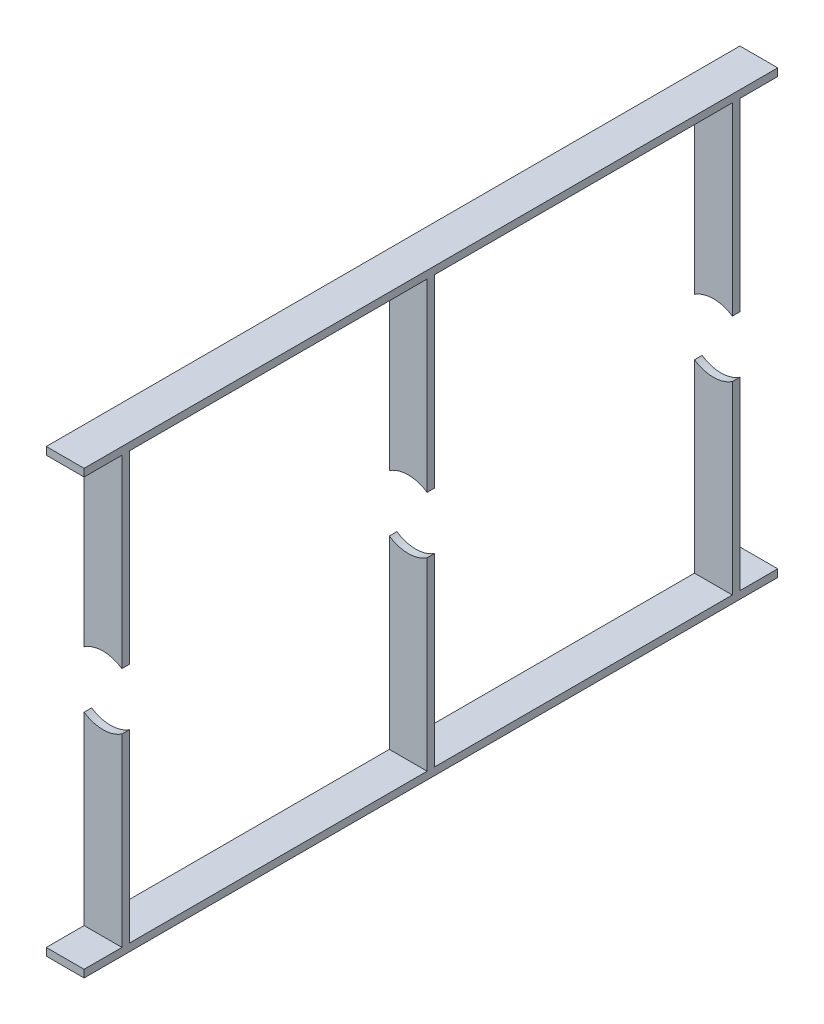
ISO-10303-21;
HEADER;
FILE_DESCRIPTION(('STEP AP214'),'2;1');
FILE_NAME('part.step','',(''),(''),'','','');
FILE_SCHEMA(('AUTOMOTIVE_DESIGN { 1 0 10303 214 1 1 1 1 }'));
ENDSEC;
DATA;
#1=APPLICATION_CONTEXT('core data for automotive mechanical design processes');
#2=APPLICATION_PROTOCOL_DEFINITION('international standard','automotive_design',2000,#1);
#3=PRODUCT_CONTEXT('',#1,'mechanical');
#4=PRODUCT('Part','Part','',(#3));
#5=PRODUCT_RELATED_PRODUCT_CATEGORY('part','',(#4));
#6=PRODUCT_DEFINITION_FORMATION('','',#4);
#7=PRODUCT_DEFINITION_CONTEXT('part definition',#1,'design');
#8=PRODUCT_DEFINITION('design','',#6,#7);
#9=PRODUCT_DEFINITION_SHAPE('','',#8);
#10=(LENGTH_UNIT() NAMED_UNIT(*) SI_UNIT(.MILLI.,.METRE.));
#11=(NAMED_UNIT(*) PLANE_ANGLE_UNIT() SI_UNIT($,.RADIAN.));
#12=(NAMED_UNIT(*) SI_UNIT($,.STERADIAN.) SOLID_ANGLE_UNIT());
#13=UNCERTAINTY_MEASURE_WITH_UNIT(LENGTH_MEASURE(1.E-05),#10,'distance_accuracy_value','');
#14=(GEOMETRIC_REPRESENTATION_CONTEXT(3) GLOBAL_UNCERTAINTY_ASSIGNED_CONTEXT((#13)) GLOBAL_UNIT_ASSIGNED_CONTEXT((#10,
#11,#12)) REPRESENTATION_CONTEXT('',''));
#15=CARTESIAN_POINT('',(0.,0.,0.));
#16=DIRECTION('',(0.,0.,1.));
#17=DIRECTION('',(1.,0.,0.));
#18=AXIS2_PLACEMENT_3D('',#15,#16,#17);
#19=CARTESIAN_POINT('',(30.0000000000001,-338.,490.));
#20=DIRECTION('',(1.,0.,0.));
#21=DIRECTION('',(0.,0.,-1.));
#22=AXIS2_PLACEMENT_3D('',#19,#20,#21);
#23=PLANE('',#22);
#24=DIRECTION('',(0.,0.,1.));
#25=VECTOR('',#24,1.);
#26=CARTESIAN_POINT('',(30.0000000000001,44.8998886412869,-494.));
#27=LINE('',#26,#25);
#28=CARTESIAN_POINT('',(30.0000000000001,44.8998886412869,-490.));
#29=VERTEX_POINT('',#28);
#30=CARTESIAN_POINT('',(30.0000000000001,44.8998886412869,-478.));
#31=VERTEX_POINT('',#30);
#32=EDGE_CURVE('E85',#29,#31,#27,.T.);
#33=ORIENTED_EDGE('',*,*,#32,.F.);
#34=DIRECTION('',(0.,1.,0.));
#35=VECTOR('',#34,1.);
#36=CARTESIAN_POINT('',(30.0000000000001,-338.,-490.));
#37=LINE('',#36,#35);
#38=CARTESIAN_POINT('',(30.,338.,-490.));
#39=VERTEX_POINT('',#38);
#40=EDGE_CURVE('E212',#29,#39,#37,.T.);
#41=ORIENTED_EDGE('',*,*,#40,.T.);
#42=DIRECTION('',(0.,0.,-1.));
#43=VECTOR('',#42,1.);
#44=CARTESIAN_POINT('',(30.,338.,550.));
#45=LINE('',#44,#43);
#46=CARTESIAN_POINT('',(30.,338.,-550.));
#47=VERTEX_POINT('',#46);
#48=EDGE_CURVE('E184',#39,#47,#45,.T.);
#49=ORIENTED_EDGE('',*,*,#48,.T.);
#50=DIRECTION('',(0.,-1.,0.));
#51=VECTOR('',#50,1.);
#52=CARTESIAN_POINT('',(30.,350.,-550.));
#53=LINE('',#52,#51);
#54=CARTESIAN_POINT('',(30.,350.,-550.));
#55=VERTEX_POINT('',#54);
#56=EDGE_CURVE('E228',#55,#47,#53,.T.);
#57=ORIENTED_EDGE('',*,*,#56,.F.);
#58=DIRECTION('',(0.,0.,-1.));
#59=VECTOR('',#58,1.);
#60=CARTESIAN_POINT('',(30.,350.,550.));
#61=LINE('',#60,#59);
#62=CARTESIAN_POINT('',(30.,350.,550.));
#63=VERTEX_POINT('',#62);
#64=EDGE_CURVE('E231',#63,#55,#61,.T.);
#65=ORIENTED_EDGE('',*,*,#64,.F.);
#66=DIRECTION('',(0.,-1.,0.));
#67=VECTOR('',#66,1.);
#68=CARTESIAN_POINT('',(30.,350.,550.));
#69=LINE('',#68,#67);
#70=CARTESIAN_POINT('',(30.,338.,550.));
#71=VERTEX_POINT('',#70);
#72=EDGE_CURVE('E233',#63,#71,#69,.T.);
#73=ORIENTED_EDGE('',*,*,#72,.T.);
#74=CARTESIAN_POINT('',(30.0000000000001,338.,490.));
#75=VERTEX_POINT('',#74);
#76=EDGE_CURVE('E235',#71,#75,#45,.T.);
#77=ORIENTED_EDGE('',*,*,#76,.T.);
#78=DIRECTION('',(0.,1.,0.));
#79=VECTOR('',#78,1.);
#80=CARTESIAN_POINT('',(30.0000000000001,-338.,490.));
#81=LINE('',#80,#79);
#82=CARTESIAN_POINT('',(30.0000000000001,44.8998886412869,490.));
#83=VERTEX_POINT('',#82);
#84=EDGE_CURVE('E206',#83,#75,#81,.T.);
#85=ORIENTED_EDGE('',*,*,#84,.F.);
#86=DIRECTION('',(0.,0.,1.));
#87=VECTOR('',#86,1.);
#88=CARTESIAN_POINT('',(30.0000000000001,44.8998886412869,-10.));
#89=LINE('',#88,#87);
#90=CARTESIAN_POINT('',(30.0000000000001,44.8998886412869,478.));
#91=VERTEX_POINT('',#90);
#92=EDGE_CURVE('E270',#91,#83,#89,.T.);
#93=ORIENTED_EDGE('',*,*,#92,.F.);
#94=DIRECTION('',(0.,1.,0.));
#95=VECTOR('',#94,1.);
#96=CARTESIAN_POINT('',(30.0000000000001,-338.,478.));
#97=LINE('',#96,#95);
#98=CARTESIAN_POINT('',(30.0000000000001,338.,478.));
#99=VERTEX_POINT('',#98);
#100=EDGE_CURVE('E238',#91,#99,#97,.T.);
#101=ORIENTED_EDGE('',*,*,#100,.T.);
#102=CARTESIAN_POINT('',(30.,338.,6.00000000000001));
#103=VERTEX_POINT('',#102);
#104=EDGE_CURVE('E201',#99,#103,#45,.T.);
#105=ORIENTED_EDGE('',*,*,#104,.T.);
#106=DIRECTION('',(0.,1.,0.));
#107=VECTOR('',#106,1.);
#108=CARTESIAN_POINT('',(30.0000000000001,-338.,6.00000000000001));
#109=LINE('',#108,#107);
#110=CARTESIAN_POINT('',(30.0000000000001,44.8998886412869,5.99999999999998));
#111=VERTEX_POINT('',#110);
#112=EDGE_CURVE('E168',#111,#103,#109,.T.);
#113=ORIENTED_EDGE('',*,*,#112,.F.);
#114=CARTESIAN_POINT('',(30.0000000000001,44.8998886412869,-6.00000000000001));
#115=VERTEX_POINT('',#114);
#116=EDGE_CURVE('E193',#115,#111,#27,.T.);
#117=ORIENTED_EDGE('',*,*,#116,.F.);
#118=DIRECTION('',(0.,1.,0.));
#119=VECTOR('',#118,1.);
#120=CARTESIAN_POINT('',(30.0000000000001,-338.,-6.00000000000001));
#121=LINE('',#120,#119);
#122=CARTESIAN_POINT('',(30.,338.,-6.00000000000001));
#123=VERTEX_POINT('',#122);
#124=EDGE_CURVE('E199',#115,#123,#121,.T.);
#125=ORIENTED_EDGE('',*,*,#124,.T.);
#126=CARTESIAN_POINT('',(30.,338.,-478.));
#127=VERTEX_POINT('',#126);
#128=EDGE_CURVE('E198',#123,#127,#45,.T.);
#129=ORIENTED_EDGE('',*,*,#128,.T.);
#130=DIRECTION('',(0.,1.,0.));
#131=VECTOR('',#130,1.);
#132=CARTESIAN_POINT('',(30.0000000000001,-338.,-478.));
#133=LINE('',#132,#131);
#134=EDGE_CURVE('E48',#31,#127,#133,.T.);
#135=ORIENTED_EDGE('',*,*,#134,.F.);
#136=EDGE_LOOP('',(#33,#41,#49,#57,#65,#73,#77,#85,#93,#101,#105,#113,#117,#125,#129,#135));
#137=FACE_BOUND('',#136,.T.);
#138=ADVANCED_FACE('F44',(#137),#23,.T.);
#139=CARTESIAN_POINT('',(30.0000000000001,-338.,-6.00000000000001));
#140=DIRECTION('',(0.,0.,-1.));
#141=DIRECTION('',(-1.,0.,0.));
#142=AXIS2_PLACEMENT_3D('',#139,#140,#141);
#143=PLANE('',#142);
#144=CARTESIAN_POINT('',(-4.53341068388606E-13,0.,-6.00000000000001));
#145=DIRECTION('',(0.,0.,-1.));
#146=DIRECTION('',(-1.,0.,0.));
#147=AXIS2_PLACEMENT_3D('',#144,#145,#146);
#148=CIRCLE('',#147,54.);
#149=CARTESIAN_POINT('',(-29.9999999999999,44.8998886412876,-6.00000000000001));
#150=VERTEX_POINT('',#149);
#151=EDGE_CURVE('E195',#150,#115,#148,.T.);
#152=ORIENTED_EDGE('',*,*,#151,.F.);
#153=DIRECTION('',(0.,1.,0.));
#154=VECTOR('',#153,1.);
#155=CARTESIAN_POINT('',(-29.9999999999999,-338.,-6.00000000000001));
#156=LINE('',#155,#154);
#157=CARTESIAN_POINT('',(-30.,338.,-6.00000000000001));
#158=VERTEX_POINT('',#157);
#159=EDGE_CURVE('E196',#150,#158,#156,.T.);
#160=ORIENTED_EDGE('',*,*,#159,.T.);
#161=DIRECTION('',(-1.,0.,0.));
#162=VECTOR('',#161,1.);
#163=CARTESIAN_POINT('',(30.0000000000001,338.,-6.00000000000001));
#164=LINE('',#163,#162);
#165=EDGE_CURVE('E192',#123,#158,#164,.T.);
#166=ORIENTED_EDGE('',*,*,#165,.F.);
#167=ORIENTED_EDGE('',*,*,#124,.F.);
#168=EDGE_LOOP('',(#152,#160,#166,#167));
#169=FACE_BOUND('',#168,.T.);
#170=ADVANCED_FACE('F324',(#169),#143,.T.);
#171=CARTESIAN_POINT('',(30.0000000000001,-338.,6.00000000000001));
#172=DIRECTION('',(0.,0.,1.));
#173=DIRECTION('',(1.,0.,0.));
#174=AXIS2_PLACEMENT_3D('',#171,#172,#173);
#175=PLANE('',#174);
#176=CARTESIAN_POINT('',(-4.53341068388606E-13,0.,5.99999999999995));
#177=DIRECTION('',(0.,0.,1.));
#178=DIRECTION('',(1.,0.,0.));
#179=AXIS2_PLACEMENT_3D('',#176,#177,#178);
#180=CIRCLE('',#179,54.);
#181=CARTESIAN_POINT('',(-29.9999999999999,44.8998886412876,5.99999999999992));
#182=VERTEX_POINT('',#181);
#183=EDGE_CURVE('E54',#111,#182,#180,.T.);
#184=ORIENTED_EDGE('',*,*,#183,.F.);
#185=ORIENTED_EDGE('',*,*,#112,.T.);
#186=DIRECTION('',(1.,0.,0.));
#187=VECTOR('',#186,1.);
#188=CARTESIAN_POINT('',(30.0000000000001,338.,6.00000000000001));
#189=LINE('',#188,#187);
#190=CARTESIAN_POINT('',(-29.9999999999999,338.,5.99999999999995));
#191=VERTEX_POINT('',#190);
#192=EDGE_CURVE('E188',#191,#103,#189,.T.);
#193=ORIENTED_EDGE('',*,*,#192,.F.);
#194=DIRECTION('',(0.,1.,0.));
#195=VECTOR('',#194,1.);
#196=CARTESIAN_POINT('',(-29.9999999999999,-338.,5.99999999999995));
#197=LINE('',#196,#195);
#198=EDGE_CURVE('E203',#182,#191,#197,.T.);
#199=ORIENTED_EDGE('',*,*,#198,.F.);
#200=EDGE_LOOP('',(#184,#185,#193,#199));
#201=FACE_BOUND('',#200,.T.);
#202=ADVANCED_FACE('F328',(#201),#175,.T.);
#203=CARTESIAN_POINT('',(30.0000000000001,-338.,-490.));
#204=DIRECTION('',(0.,0.,-1.));
#205=DIRECTION('',(-1.,0.,0.));
#206=AXIS2_PLACEMENT_3D('',#203,#204,#205);
#207=PLANE('',#206);
#208=CARTESIAN_POINT('',(-4.53341068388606E-13,0.,-490.));
#209=DIRECTION('',(0.,0.,-1.));
#210=DIRECTION('',(-1.,0.,0.));
#211=AXIS2_PLACEMENT_3D('',#208,#209,#210);
#212=CIRCLE('',#211,54.);
#213=CARTESIAN_POINT('',(-29.9999999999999,44.8998886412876,-490.));
#214=VERTEX_POINT('',#213);
#215=EDGE_CURVE('E166',#214,#29,#212,.T.);
#216=ORIENTED_EDGE('',*,*,#215,.F.);
#217=DIRECTION('',(0.,1.,0.));
#218=VECTOR('',#217,1.);
#219=CARTESIAN_POINT('',(-29.9999999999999,-338.,-490.));
#220=LINE('',#219,#218);
#221=CARTESIAN_POINT('',(-29.9999999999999,338.,-490.));
#222=VERTEX_POINT('',#221);
#223=EDGE_CURVE('E160',#214,#222,#220,.T.);
#224=ORIENTED_EDGE('',*,*,#223,.T.);
#225=DIRECTION('',(-1.,0.,0.));
#226=VECTOR('',#225,1.);
#227=CARTESIAN_POINT('',(30.0000000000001,338.,-490.));
#228=LINE('',#227,#226);
#229=EDGE_CURVE('E165',#39,#222,#228,.T.);
#230=ORIENTED_EDGE('',*,*,#229,.F.);
#231=ORIENTED_EDGE('',*,*,#40,.F.);
#232=EDGE_LOOP('',(#216,#224,#230,#231));
#233=FACE_BOUND('',#232,.T.);
#234=ADVANCED_FACE('F162',(#233),#207,.T.);
#235=CARTESIAN_POINT('',(30.0000000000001,-338.,-478.));
#236=DIRECTION('',(0.,0.,1.));
#237=DIRECTION('',(1.,0.,0.));
#238=AXIS2_PLACEMENT_3D('',#235,#236,#237);
#239=PLANE('',#238);
#240=CARTESIAN_POINT('',(-4.53341068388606E-13,0.,-478.));
#241=DIRECTION('',(0.,0.,1.));
#242=DIRECTION('',(1.,0.,0.));
#243=AXIS2_PLACEMENT_3D('',#240,#241,#242);
#244=CIRCLE('',#243,54.);
#245=CARTESIAN_POINT('',(-29.9999999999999,44.8998886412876,-478.));
#246=VERTEX_POINT('',#245);
#247=EDGE_CURVE('E82',#31,#246,#244,.T.);
#248=ORIENTED_EDGE('',*,*,#247,.F.);
#249=ORIENTED_EDGE('',*,*,#134,.T.);
#250=DIRECTION('',(1.,0.,0.));
#251=VECTOR('',#250,1.);
#252=CARTESIAN_POINT('',(30.0000000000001,338.,-478.));
#253=LINE('',#252,#251);
#254=CARTESIAN_POINT('',(-30.,338.,-478.));
#255=VERTEX_POINT('',#254);
#256=EDGE_CURVE('E178',#255,#127,#253,.T.);
#257=ORIENTED_EDGE('',*,*,#256,.F.);
#258=DIRECTION('',(0.,1.,0.));
#259=VECTOR('',#258,1.);
#260=CARTESIAN_POINT('',(-29.9999999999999,-338.,-478.));
#261=LINE('',#260,#259);
#262=EDGE_CURVE('E214',#246,#255,#261,.T.);
#263=ORIENTED_EDGE('',*,*,#262,.F.);
#264=EDGE_LOOP('',(#248,#249,#257,#263));
#265=FACE_BOUND('',#264,.T.);
#266=ADVANCED_FACE('F334',(#265),#239,.T.);
#267=CARTESIAN_POINT('',(0.,338.,0.));
#268=DIRECTION('',(0.,-1.,0.));
#269=DIRECTION('',(0.,0.,-1.));
#270=AXIS2_PLACEMENT_3D('',#267,#268,#269);
#271=PLANE('',#270);
#272=ORIENTED_EDGE('',*,*,#229,.T.);
#273=DIRECTION('',(0.,0.,-1.));
#274=VECTOR('',#273,1.);
#275=CARTESIAN_POINT('',(-30.,338.,550.));
#276=LINE('',#275,#274);
#277=CARTESIAN_POINT('',(-30.,338.,-550.));
#278=VERTEX_POINT('',#277);
#279=EDGE_CURVE('E170',#222,#278,#276,.T.);
#280=ORIENTED_EDGE('',*,*,#279,.T.);
#281=DIRECTION('',(-1.,0.,0.));
#282=VECTOR('',#281,1.);
#283=CARTESIAN_POINT('',(30.,338.,-550.));
#284=LINE('',#283,#282);
#285=EDGE_CURVE('E232',#47,#278,#284,.T.);
#286=ORIENTED_EDGE('',*,*,#285,.F.);
#287=ORIENTED_EDGE('',*,*,#48,.F.);
#288=EDGE_LOOP('',(#272,#280,#286,#287));
#289=FACE_BOUND('',#288,.T.);
#290=ADVANCED_FACE('F183',(#289),#271,.T.);
#291=ORIENTED_EDGE('',*,*,#256,.T.);
#292=ORIENTED_EDGE('',*,*,#128,.F.);
#293=ORIENTED_EDGE('',*,*,#165,.T.);
#294=EDGE_CURVE('E180',#158,#255,#276,.T.);
#295=ORIENTED_EDGE('',*,*,#294,.T.);
#296=EDGE_LOOP('',(#291,#292,#293,#295));
#297=FACE_BOUND('',#296,.T.);
#298=ADVANCED_FACE('F320',(#297),#271,.T.);
#299=CARTESIAN_POINT('',(30.0000000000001,-338.,478.));
#300=DIRECTION('',(0.,0.,-1.));
#301=DIRECTION('',(-1.,0.,0.));
#302=AXIS2_PLACEMENT_3D('',#299,#300,#301);
#303=PLANE('',#302);
#304=CARTESIAN_POINT('',(-4.53341068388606E-13,0.,478.));
#305=DIRECTION('',(0.,0.,-1.));
#306=DIRECTION('',(-1.,0.,0.));
#307=AXIS2_PLACEMENT_3D('',#304,#305,#306);
#308=CIRCLE('',#307,54.);
#309=CARTESIAN_POINT('',(-29.9999999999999,44.8998886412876,478.));
#310=VERTEX_POINT('',#309);
#311=EDGE_CURVE('E219',#310,#91,#308,.T.);
#312=ORIENTED_EDGE('',*,*,#311,.F.);
#313=DIRECTION('',(0.,1.,0.));
#314=VECTOR('',#313,1.);
#315=CARTESIAN_POINT('',(-29.9999999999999,-338.,478.));
#316=LINE('',#315,#314);
#317=CARTESIAN_POINT('',(-30.,338.,478.));
#318=VERTEX_POINT('',#317);
#319=EDGE_CURVE('E255',#310,#318,#316,.T.);
#320=ORIENTED_EDGE('',*,*,#319,.T.);
#321=DIRECTION('',(-1.,0.,0.));
#322=VECTOR('',#321,1.);
#323=CARTESIAN_POINT('',(30.0000000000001,338.,478.));
#324=LINE('',#323,#322);
#325=EDGE_CURVE('E259',#99,#318,#324,.T.);
#326=ORIENTED_EDGE('',*,*,#325,.F.);
#327=ORIENTED_EDGE('',*,*,#100,.F.);
#328=EDGE_LOOP('',(#312,#320,#326,#327));
#329=FACE_BOUND('',#328,.T.);
#330=ADVANCED_FACE('F288',(#329),#303,.T.);
#331=CARTESIAN_POINT('',(30.0000000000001,-338.,490.));
#332=DIRECTION('',(0.,0.,1.));
#333=DIRECTION('',(1.,0.,0.));
#334=AXIS2_PLACEMENT_3D('',#331,#332,#333);
#335=PLANE('',#334);
#336=CARTESIAN_POINT('',(-4.53341068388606E-13,0.,490.));
#337=DIRECTION('',(0.,0.,1.));
#338=DIRECTION('',(1.,0.,0.));
#339=AXIS2_PLACEMENT_3D('',#336,#337,#338);
#340=CIRCLE('',#339,54.);
#341=CARTESIAN_POINT('',(-29.9999999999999,44.8998886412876,490.));
#342=VERTEX_POINT('',#341);
#343=EDGE_CURVE('E242',#83,#342,#340,.T.);
#344=ORIENTED_EDGE('',*,*,#343,.F.);
#345=ORIENTED_EDGE('',*,*,#84,.T.);
#346=DIRECTION('',(1.,0.,0.));
#347=VECTOR('',#346,1.);
#348=CARTESIAN_POINT('',(30.0000000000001,338.,490.));
#349=LINE('',#348,#347);
#350=CARTESIAN_POINT('',(-29.9999999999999,338.,490.));
#351=VERTEX_POINT('',#350);
#352=EDGE_CURVE('E241',#351,#75,#349,.T.);
#353=ORIENTED_EDGE('',*,*,#352,.F.);
#354=DIRECTION('',(0.,1.,0.));
#355=VECTOR('',#354,1.);
#356=CARTESIAN_POINT('',(-29.9999999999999,-338.,490.));
#357=LINE('',#356,#355);
#358=EDGE_CURVE('E205',#342,#351,#357,.T.);
#359=ORIENTED_EDGE('',*,*,#358,.F.);
#360=EDGE_LOOP('',(#344,#345,#353,#359));
#361=FACE_BOUND('',#360,.T.);
#362=ADVANCED_FACE('F312',(#361),#335,.T.);
#363=CARTESIAN_POINT('',(-29.9999999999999,-338.,490.));
#364=DIRECTION('',(-1.,0.,0.));
#365=DIRECTION('',(0.,0.,1.));
#366=AXIS2_PLACEMENT_3D('',#363,#364,#365);
#367=PLANE('',#366);
#368=DIRECTION('',(0.,0.,1.));
#369=VECTOR('',#368,1.);
#370=CARTESIAN_POINT('',(-29.9999999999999,44.8998886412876,-494.));
#371=LINE('',#370,#369);
#372=EDGE_CURVE('E12',#182,#150,#371,.F.);
#373=ORIENTED_EDGE('',*,*,#372,.F.);
#374=ORIENTED_EDGE('',*,*,#198,.T.);
#375=EDGE_CURVE('E211',#318,#191,#276,.T.);
#376=ORIENTED_EDGE('',*,*,#375,.F.);
#377=ORIENTED_EDGE('',*,*,#319,.F.);
#378=DIRECTION('',(0.,0.,1.));
#379=VECTOR('',#378,1.);
#380=CARTESIAN_POINT('',(-29.9999999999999,44.8998886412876,-10.));
#381=LINE('',#380,#379);
#382=EDGE_CURVE('E215',#342,#310,#381,.F.);
#383=ORIENTED_EDGE('',*,*,#382,.F.);
#384=ORIENTED_EDGE('',*,*,#358,.T.);
#385=CARTESIAN_POINT('',(-30.,338.,550.));
#386=VERTEX_POINT('',#385);
#387=EDGE_CURVE('E181',#386,#351,#276,.T.);
#388=ORIENTED_EDGE('',*,*,#387,.F.);
#389=DIRECTION('',(0.,-1.,0.));
#390=VECTOR('',#389,1.);
#391=CARTESIAN_POINT('',(-30.,350.,550.));
#392=LINE('',#391,#390);
#393=CARTESIAN_POINT('',(-30.,350.,550.));
#394=VERTEX_POINT('',#393);
#395=EDGE_CURVE('E226',#394,#386,#392,.T.);
#396=ORIENTED_EDGE('',*,*,#395,.F.);
#397=DIRECTION('',(0.,0.,-1.));
#398=VECTOR('',#397,1.);
#399=CARTESIAN_POINT('',(-30.,350.,550.));
#400=LINE('',#399,#398);
#401=CARTESIAN_POINT('',(-30.,350.,-550.));
#402=VERTEX_POINT('',#401);
#403=EDGE_CURVE('E221',#394,#402,#400,.T.);
#404=ORIENTED_EDGE('',*,*,#403,.T.);
#405=DIRECTION('',(0.,-1.,0.));
#406=VECTOR('',#405,1.);
#407=CARTESIAN_POINT('',(-30.,350.,-550.));
#408=LINE('',#407,#406);
#409=EDGE_CURVE('E174',#402,#278,#408,.T.);
#410=ORIENTED_EDGE('',*,*,#409,.T.);
#411=ORIENTED_EDGE('',*,*,#279,.F.);
#412=ORIENTED_EDGE('',*,*,#223,.F.);
#413=EDGE_CURVE('E56',#246,#214,#371,.F.);
#414=ORIENTED_EDGE('',*,*,#413,.F.);
#415=ORIENTED_EDGE('',*,*,#262,.T.);
#416=ORIENTED_EDGE('',*,*,#294,.F.);
#417=ORIENTED_EDGE('',*,*,#159,.F.);
#418=EDGE_LOOP('',(#373,#374,#376,#377,#383,#384,#388,#396,#404,#410,#411,#412,#414,#415,#416,#417));
#419=FACE_BOUND('',#418,.T.);
#420=ADVANCED_FACE('F171',(#419),#367,.T.);
#421=CARTESIAN_POINT('',(-4.53341068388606E-13,0.,-10.));
#422=DIRECTION('',(0.,0.,1.));
#423=DIRECTION('',(1.,0.,0.));
#424=AXIS2_PLACEMENT_3D('',#421,#422,#423);
#425=CYLINDRICAL_SURFACE('',#424,54.);
#426=ORIENTED_EDGE('',*,*,#382,.T.);
#427=ORIENTED_EDGE('',*,*,#311,.T.);
#428=ORIENTED_EDGE('',*,*,#92,.T.);
#429=ORIENTED_EDGE('',*,*,#343,.T.);
#430=EDGE_LOOP('',(#426,#427,#428,#429));
#431=FACE_BOUND('',#430,.T.);
#432=ADVANCED_FACE('F279',(#431),#425,.F.);
#433=ORIENTED_EDGE('',*,*,#387,.T.);
#434=ORIENTED_EDGE('',*,*,#352,.T.);
#435=ORIENTED_EDGE('',*,*,#76,.F.);
#436=DIRECTION('',(-1.,0.,0.));
#437=VECTOR('',#436,1.);
#438=CARTESIAN_POINT('',(30.,338.,550.));
#439=LINE('',#438,#437);
#440=EDGE_CURVE('E243',#71,#386,#439,.T.);
#441=ORIENTED_EDGE('',*,*,#440,.T.);
#442=EDGE_LOOP('',(#433,#434,#435,#441));
#443=FACE_BOUND('',#442,.T.);
#444=ADVANCED_FACE('F306',(#443),#271,.T.);
#445=CARTESIAN_POINT('',(30.,350.,550.));
#446=DIRECTION('',(0.,0.,1.));
#447=DIRECTION('',(1.,0.,0.));
#448=AXIS2_PLACEMENT_3D('',#445,#446,#447);
#449=PLANE('',#448);
#450=ORIENTED_EDGE('',*,*,#440,.F.);
#451=ORIENTED_EDGE('',*,*,#72,.F.);
#452=DIRECTION('',(-1.,0.,0.));
#453=VECTOR('',#452,1.);
#454=CARTESIAN_POINT('',(30.,350.,550.));
#455=LINE('',#454,#453);
#456=EDGE_CURVE('E246',#63,#394,#455,.T.);
#457=ORIENTED_EDGE('',*,*,#456,.T.);
#458=ORIENTED_EDGE('',*,*,#395,.T.);
#459=EDGE_LOOP('',(#450,#451,#457,#458));
#460=FACE_BOUND('',#459,.T.);
#461=ADVANCED_FACE('F308',(#460),#449,.T.);
#462=CARTESIAN_POINT('',(30.,350.,-550.));
#463=DIRECTION('',(0.,0.,1.));
#464=DIRECTION('',(1.,0.,0.));
#465=AXIS2_PLACEMENT_3D('',#462,#463,#464);
#466=PLANE('',#465);
#467=ORIENTED_EDGE('',*,*,#285,.T.);
#468=ORIENTED_EDGE('',*,*,#409,.F.);
#469=DIRECTION('',(-1.,0.,0.));
#470=VECTOR('',#469,1.);
#471=CARTESIAN_POINT('',(30.,350.,-550.));
#472=LINE('',#471,#470);
#473=EDGE_CURVE('E248',#55,#402,#472,.T.);
#474=ORIENTED_EDGE('',*,*,#473,.F.);
#475=ORIENTED_EDGE('',*,*,#56,.T.);
#476=EDGE_LOOP('',(#467,#468,#474,#475));
#477=FACE_BOUND('',#476,.T.);
#478=ADVANCED_FACE('F297',(#477),#466,.F.);
#479=CARTESIAN_POINT('',(0.,350.,0.));
#480=DIRECTION('',(0.,-1.,0.));
#481=DIRECTION('',(0.,0.,-1.));
#482=AXIS2_PLACEMENT_3D('',#479,#480,#481);
#483=PLANE('',#482);
#484=ORIENTED_EDGE('',*,*,#456,.F.);
#485=ORIENTED_EDGE('',*,*,#64,.T.);
#486=ORIENTED_EDGE('',*,*,#473,.T.);
#487=ORIENTED_EDGE('',*,*,#403,.F.);
#488=EDGE_LOOP('',(#484,#485,#486,#487));
#489=FACE_BOUND('',#488,.T.);
#490=ADVANCED_FACE('F301',(#489),#483,.F.);
#491=ORIENTED_EDGE('',*,*,#192,.T.);
#492=ORIENTED_EDGE('',*,*,#104,.F.);
#493=ORIENTED_EDGE('',*,*,#325,.T.);
#494=ORIENTED_EDGE('',*,*,#375,.T.);
#495=EDGE_LOOP('',(#491,#492,#493,#494));
#496=FACE_BOUND('',#495,.T.);
#497=ADVANCED_FACE('F289',(#496),#271,.T.);
#498=CARTESIAN_POINT('',(-4.53341068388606E-13,0.,-494.));
#499=DIRECTION('',(0.,0.,1.));
#500=DIRECTION('',(1.,0.,0.));
#501=AXIS2_PLACEMENT_3D('',#498,#499,#500);
#502=CYLINDRICAL_SURFACE('',#501,54.);
#503=ORIENTED_EDGE('',*,*,#215,.T.);
#504=ORIENTED_EDGE('',*,*,#32,.T.);
#505=ORIENTED_EDGE('',*,*,#247,.T.);
#506=ORIENTED_EDGE('',*,*,#413,.T.);
#507=EDGE_LOOP('',(#503,#504,#505,#506));
#508=FACE_BOUND('',#507,.T.);
#509=ADVANCED_FACE('F46',(#508),#502,.F.);
#510=ORIENTED_EDGE('',*,*,#151,.T.);
#511=ORIENTED_EDGE('',*,*,#116,.T.);
#512=ORIENTED_EDGE('',*,*,#183,.T.);
#513=ORIENTED_EDGE('',*,*,#372,.T.);
#514=EDGE_LOOP('',(#510,#511,#512,#513));
#515=FACE_BOUND('',#514,.T.);
#516=ADVANCED_FACE('F364',(#515),#502,.F.);
#517=CLOSED_SHELL('',(#138,#170,#202,#234,#266,#290,#298,#330,#362,#420,#432,#444,#461,#478,
#490,#497,#509,#516));
#518=MANIFOLD_SOLID_BREP('B2',#517);
#519=CARTESIAN_POINT('',(0.,-338.,0.));
#520=DIRECTION('',(0.,-1.,0.));
#521=DIRECTION('',(0.,0.,-1.));
#522=AXIS2_PLACEMENT_3D('',#519,#520,#521);
#523=PLANE('',#522);
#524=DIRECTION('',(0.,0.,-1.));
#525=VECTOR('',#524,1.);
#526=CARTESIAN_POINT('',(30.,-338.,550.));
#527=LINE('',#526,#525);
#528=CARTESIAN_POINT('',(30.,-338.,478.));
#529=VERTEX_POINT('',#528);
#530=CARTESIAN_POINT('',(30.0000000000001,-338.,6.00000000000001));
#531=VERTEX_POINT('',#530);
#532=EDGE_CURVE('E667',#529,#531,#527,.T.);
#533=ORIENTED_EDGE('',*,*,#532,.T.);
#534=DIRECTION('',(1.,0.,0.));
#535=VECTOR('',#534,1.);
#536=CARTESIAN_POINT('',(30.0000000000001,-338.,6.00000000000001));
#537=LINE('',#536,#535);
#538=CARTESIAN_POINT('',(-29.9999999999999,-338.,5.99999999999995));
#539=VERTEX_POINT('',#538);
#540=EDGE_CURVE('E616',#539,#531,#537,.T.);
#541=ORIENTED_EDGE('',*,*,#540,.F.);
#542=DIRECTION('',(0.,0.,-1.));
#543=VECTOR('',#542,1.);
#544=CARTESIAN_POINT('',(-30.,-338.,550.));
#545=LINE('',#544,#543);
#546=CARTESIAN_POINT('',(-30.,-338.,478.));
#547=VERTEX_POINT('',#546);
#548=EDGE_CURVE('E660',#547,#539,#545,.T.);
#549=ORIENTED_EDGE('',*,*,#548,.F.);
#550=DIRECTION('',(-1.,0.,0.));
#551=VECTOR('',#550,1.);
#552=CARTESIAN_POINT('',(30.0000000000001,-338.,478.));
#553=LINE('',#552,#551);
#554=EDGE_CURVE('E695',#529,#547,#553,.T.);
#555=ORIENTED_EDGE('',*,*,#554,.F.);
#556=EDGE_LOOP('',(#533,#541,#549,#555));
#557=FACE_BOUND('',#556,.T.);
#558=ADVANCED_FACE('F479',(#557),#523,.F.);
#559=CARTESIAN_POINT('',(-30.,-338.,-6.00000000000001));
#560=VERTEX_POINT('',#559);
#561=CARTESIAN_POINT('',(-30.,-338.,-478.));
#562=VERTEX_POINT('',#561);
#563=EDGE_CURVE('E661',#560,#562,#545,.T.);
#564=ORIENTED_EDGE('',*,*,#563,.F.);
#565=DIRECTION('',(-1.,0.,0.));
#566=VECTOR('',#565,1.);
#567=CARTESIAN_POINT('',(30.0000000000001,-338.,-6.00000000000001));
#568=LINE('',#567,#566);
#569=CARTESIAN_POINT('',(30.0000000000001,-338.,-6.00000000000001));
#570=VERTEX_POINT('',#569);
#571=EDGE_CURVE('E494',#570,#560,#568,.T.);
#572=ORIENTED_EDGE('',*,*,#571,.F.);
#573=CARTESIAN_POINT('',(30.,-338.,-478.));
#574=VERTEX_POINT('',#573);
#575=EDGE_CURVE('E668',#570,#574,#527,.T.);
#576=ORIENTED_EDGE('',*,*,#575,.T.);
#577=DIRECTION('',(1.,0.,0.));
#578=VECTOR('',#577,1.);
#579=CARTESIAN_POINT('',(30.0000000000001,-338.,-478.));
#580=LINE('',#579,#578);
#581=EDGE_CURVE('E638',#562,#574,#580,.T.);
#582=ORIENTED_EDGE('',*,*,#581,.F.);
#583=EDGE_LOOP('',(#564,#572,#576,#582));
#584=FACE_BOUND('',#583,.T.);
#585=ADVANCED_FACE('F762',(#584),#523,.F.);
#586=CARTESIAN_POINT('',(30.0000000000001,-338.,490.));
#587=DIRECTION('',(0.,0.,1.));
#588=DIRECTION('',(1.,0.,0.));
#589=AXIS2_PLACEMENT_3D('',#586,#587,#588);
#590=PLANE('',#589);
#591=CARTESIAN_POINT('',(-4.53341068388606E-13,0.,490.));
#592=DIRECTION('',(0.,0.,1.));
#593=DIRECTION('',(1.,0.,0.));
#594=AXIS2_PLACEMENT_3D('',#591,#592,#593);
#595=CIRCLE('',#594,54.);
#596=CARTESIAN_POINT('',(-29.9999999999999,-44.8998886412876,490.));
#597=VERTEX_POINT('',#596);
#598=CARTESIAN_POINT('',(30.0000000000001,-44.8998886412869,490.));
#599=VERTEX_POINT('',#598);
#600=EDGE_CURVE('E42',#597,#599,#595,.T.);
#601=ORIENTED_EDGE('',*,*,#600,.F.);
#602=DIRECTION('',(0.,1.,0.));
#603=VECTOR('',#602,1.);
#604=CARTESIAN_POINT('',(-29.9999999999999,-338.,490.));
#605=LINE('',#604,#603);
#606=CARTESIAN_POINT('',(-30.,-338.,490.));
#607=VERTEX_POINT('',#606);
#608=EDGE_CURVE('E698',#607,#597,#605,.T.);
#609=ORIENTED_EDGE('',*,*,#608,.F.);
#610=DIRECTION('',(1.,0.,0.));
#611=VECTOR('',#610,1.);
#612=CARTESIAN_POINT('',(30.0000000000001,-338.,490.));
#613=LINE('',#612,#611);
#614=CARTESIAN_POINT('',(30.0000000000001,-338.,490.));
#615=VERTEX_POINT('',#614);
#616=EDGE_CURVE('E692',#607,#615,#613,.T.);
#617=ORIENTED_EDGE('',*,*,#616,.T.);
#618=DIRECTION('',(0.,1.,0.));
#619=VECTOR('',#618,1.);
#620=CARTESIAN_POINT('',(30.0000000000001,-338.,490.));
#621=LINE('',#620,#619);
#622=EDGE_CURVE('E704',#615,#599,#621,.T.);
#623=ORIENTED_EDGE('',*,*,#622,.T.);
#624=EDGE_LOOP('',(#601,#609,#617,#623));
#625=FACE_BOUND('',#624,.T.);
#626=ADVANCED_FACE('F714',(#625),#590,.T.);
#627=CARTESIAN_POINT('',(30.0000000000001,-338.,490.));
#628=DIRECTION('',(1.,0.,0.));
#629=DIRECTION('',(0.,0.,-1.));
#630=AXIS2_PLACEMENT_3D('',#627,#628,#629);
#631=PLANE('',#630);
#632=DIRECTION('',(0.,0.,1.));
#633=VECTOR('',#632,1.);
#634=CARTESIAN_POINT('',(30.0000000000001,-44.8998886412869,-10.));
#635=LINE('',#634,#633);
#636=CARTESIAN_POINT('',(30.0000000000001,-44.8998886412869,478.));
#637=VERTEX_POINT('',#636);
#638=EDGE_CURVE('E680',#599,#637,#635,.F.);
#639=ORIENTED_EDGE('',*,*,#638,.F.);
#640=ORIENTED_EDGE('',*,*,#622,.F.);
#641=CARTESIAN_POINT('',(30.,-338.,550.));
#642=VERTEX_POINT('',#641);
#643=EDGE_CURVE('E664',#642,#615,#527,.T.);
#644=ORIENTED_EDGE('',*,*,#643,.F.);
#645=DIRECTION('',(0.,-1.,0.));
#646=VECTOR('',#645,1.);
#647=CARTESIAN_POINT('',(30.,-338.,550.));
#648=LINE('',#647,#646);
#649=CARTESIAN_POINT('',(30.,-350.,550.));
#650=VERTEX_POINT('',#649);
#651=EDGE_CURVE('E678',#642,#650,#648,.T.);
#652=ORIENTED_EDGE('',*,*,#651,.T.);
#653=DIRECTION('',(0.,0.,-1.));
#654=VECTOR('',#653,1.);
#655=CARTESIAN_POINT('',(30.,-350.,550.));
#656=LINE('',#655,#654);
#657=CARTESIAN_POINT('',(30.,-350.,-550.));
#658=VERTEX_POINT('',#657);
#659=EDGE_CURVE('E655',#650,#658,#656,.T.);
#660=ORIENTED_EDGE('',*,*,#659,.T.);
#661=DIRECTION('',(0.,-1.,0.));
#662=VECTOR('',#661,1.);
#663=CARTESIAN_POINT('',(30.,-338.,-550.));
#664=LINE('',#663,#662);
#665=CARTESIAN_POINT('',(30.,-338.,-550.));
#666=VERTEX_POINT('',#665);
#667=EDGE_CURVE('E681',#666,#658,#664,.T.);
#668=ORIENTED_EDGE('',*,*,#667,.F.);
#669=CARTESIAN_POINT('',(30.0000000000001,-338.,-490.));
#670=VERTEX_POINT('',#669);
#671=EDGE_CURVE('E663',#670,#666,#527,.T.);
#672=ORIENTED_EDGE('',*,*,#671,.F.);
#673=DIRECTION('',(0.,1.,0.));
#674=VECTOR('',#673,1.);
#675=CARTESIAN_POINT('',(30.0000000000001,-338.,-490.));
#676=LINE('',#675,#674);
#677=CARTESIAN_POINT('',(30.0000000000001,-44.8998886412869,-490.));
#678=VERTEX_POINT('',#677);
#679=EDGE_CURVE('E632',#670,#678,#676,.T.);
#680=ORIENTED_EDGE('',*,*,#679,.T.);
#681=DIRECTION('',(0.,0.,1.));
#682=VECTOR('',#681,1.);
#683=CARTESIAN_POINT('',(30.0000000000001,-44.8998886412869,-494.));
#684=LINE('',#683,#682);
#685=CARTESIAN_POINT('',(30.0000000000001,-44.8998886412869,-478.));
#686=VERTEX_POINT('',#685);
#687=EDGE_CURVE('E627',#686,#678,#684,.F.);
#688=ORIENTED_EDGE('',*,*,#687,.F.);
#689=DIRECTION('',(0.,1.,0.));
#690=VECTOR('',#689,1.);
#691=CARTESIAN_POINT('',(30.0000000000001,-338.,-478.));
#692=LINE('',#691,#690);
#693=EDGE_CURVE('E634',#574,#686,#692,.T.);
#694=ORIENTED_EDGE('',*,*,#693,.F.);
#695=ORIENTED_EDGE('',*,*,#575,.F.);
#696=DIRECTION('',(0.,1.,0.));
#697=VECTOR('',#696,1.);
#698=CARTESIAN_POINT('',(30.0000000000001,-338.,-6.00000000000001));
#699=LINE('',#698,#697);
#700=CARTESIAN_POINT('',(30.0000000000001,-44.8998886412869,-6.00000000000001));
#701=VERTEX_POINT('',#700);
#702=EDGE_CURVE('E611',#570,#701,#699,.T.);
#703=ORIENTED_EDGE('',*,*,#702,.T.);
#704=DIRECTION('',(0.,0.,1.));
#705=VECTOR('',#704,1.);
#706=CARTESIAN_POINT('',(30.0000000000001,-44.8998886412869,-494.));
#707=LINE('',#706,#705);
#708=CARTESIAN_POINT('',(30.0000000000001,-44.8998886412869,5.99999999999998));
#709=VERTEX_POINT('',#708);
#710=EDGE_CURVE('E595',#709,#701,#707,.F.);
#711=ORIENTED_EDGE('',*,*,#710,.F.);
#712=DIRECTION('',(0.,1.,0.));
#713=VECTOR('',#712,1.);
#714=CARTESIAN_POINT('',(30.0000000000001,-338.,6.00000000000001));
#715=LINE('',#714,#713);
#716=EDGE_CURVE('E608',#531,#709,#715,.T.);
#717=ORIENTED_EDGE('',*,*,#716,.F.);
#718=ORIENTED_EDGE('',*,*,#532,.F.);
#719=DIRECTION('',(0.,1.,0.));
#720=VECTOR('',#719,1.);
#721=CARTESIAN_POINT('',(30.0000000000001,-338.,478.));
#722=LINE('',#721,#720);
#723=EDGE_CURVE('E701',#529,#637,#722,.T.);
#724=ORIENTED_EDGE('',*,*,#723,.T.);
#725=EDGE_LOOP('',(#639,#640,#644,#652,#660,#668,#672,#680,#688,#694,#695,#703,#711,#717,#718,#724));
#726=FACE_BOUND('',#725,.T.);
#727=ADVANCED_FACE('F606',(#726),#631,.T.);
#728=CARTESIAN_POINT('',(30.0000000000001,-338.,478.));
#729=DIRECTION('',(0.,0.,-1.));
#730=DIRECTION('',(-1.,0.,0.));
#731=AXIS2_PLACEMENT_3D('',#728,#729,#730);
#732=PLANE('',#731);
#733=CARTESIAN_POINT('',(-4.53341068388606E-13,0.,478.));
#734=DIRECTION('',(0.,0.,-1.));
#735=DIRECTION('',(-1.,0.,0.));
#736=AXIS2_PLACEMENT_3D('',#733,#734,#735);
#737=CIRCLE('',#736,54.);
#738=CARTESIAN_POINT('',(-29.9999999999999,-44.8998886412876,478.));
#739=VERTEX_POINT('',#738);
#740=EDGE_CURVE('E688',#637,#739,#737,.T.);
#741=ORIENTED_EDGE('',*,*,#740,.F.);
#742=ORIENTED_EDGE('',*,*,#723,.F.);
#743=ORIENTED_EDGE('',*,*,#554,.T.);
#744=DIRECTION('',(0.,1.,0.));
#745=VECTOR('',#744,1.);
#746=CARTESIAN_POINT('',(-29.9999999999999,-338.,478.));
#747=LINE('',#746,#745);
#748=EDGE_CURVE('E487',#547,#739,#747,.T.);
#749=ORIENTED_EDGE('',*,*,#748,.T.);
#750=EDGE_LOOP('',(#741,#742,#743,#749));
#751=FACE_BOUND('',#750,.T.);
#752=ADVANCED_FACE('F722',(#751),#732,.T.);
#753=CARTESIAN_POINT('',(-29.9999999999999,-338.,490.));
#754=DIRECTION('',(-1.,0.,0.));
#755=DIRECTION('',(0.,0.,1.));
#756=AXIS2_PLACEMENT_3D('',#753,#754,#755);
#757=PLANE('',#756);
#758=DIRECTION('',(0.,0.,1.));
#759=VECTOR('',#758,1.);
#760=CARTESIAN_POINT('',(-29.9999999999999,-44.8998886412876,-10.));
#761=LINE('',#760,#759);
#762=EDGE_CURVE('E690',#739,#597,#761,.T.);
#763=ORIENTED_EDGE('',*,*,#762,.F.);
#764=ORIENTED_EDGE('',*,*,#748,.F.);
#765=ORIENTED_EDGE('',*,*,#548,.T.);
#766=DIRECTION('',(0.,1.,0.));
#767=VECTOR('',#766,1.);
#768=CARTESIAN_POINT('',(-29.9999999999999,-338.,5.99999999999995));
#769=LINE('',#768,#767);
#770=CARTESIAN_POINT('',(-29.9999999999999,-44.8998886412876,5.99999999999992));
#771=VERTEX_POINT('',#770);
#772=EDGE_CURVE('E618',#539,#771,#769,.T.);
#773=ORIENTED_EDGE('',*,*,#772,.T.);
#774=DIRECTION('',(0.,0.,1.));
#775=VECTOR('',#774,1.);
#776=CARTESIAN_POINT('',(-29.9999999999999,-44.8998886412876,-494.));
#777=LINE('',#776,#775);
#778=CARTESIAN_POINT('',(-29.9999999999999,-44.8998886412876,-6.00000000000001));
#779=VERTEX_POINT('',#778);
#780=EDGE_CURVE('E598',#779,#771,#777,.T.);
#781=ORIENTED_EDGE('',*,*,#780,.F.);
#782=DIRECTION('',(0.,1.,0.));
#783=VECTOR('',#782,1.);
#784=CARTESIAN_POINT('',(-29.9999999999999,-338.,-6.00000000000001));
#785=LINE('',#784,#783);
#786=EDGE_CURVE('E620',#560,#779,#785,.T.);
#787=ORIENTED_EDGE('',*,*,#786,.F.);
#788=ORIENTED_EDGE('',*,*,#563,.T.);
#789=DIRECTION('',(0.,1.,0.));
#790=VECTOR('',#789,1.);
#791=CARTESIAN_POINT('',(-29.9999999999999,-338.,-478.));
#792=LINE('',#791,#790);
#793=CARTESIAN_POINT('',(-29.9999999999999,-44.8998886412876,-478.));
#794=VERTEX_POINT('',#793);
#795=EDGE_CURVE('E629',#562,#794,#792,.T.);
#796=ORIENTED_EDGE('',*,*,#795,.T.);
#797=DIRECTION('',(0.,0.,1.));
#798=VECTOR('',#797,1.);
#799=CARTESIAN_POINT('',(-29.9999999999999,-44.8998886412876,-494.));
#800=LINE('',#799,#798);
#801=CARTESIAN_POINT('',(-29.9999999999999,-44.8998886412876,-490.));
#802=VERTEX_POINT('',#801);
#803=EDGE_CURVE('E628',#802,#794,#800,.T.);
#804=ORIENTED_EDGE('',*,*,#803,.F.);
#805=DIRECTION('',(0.,1.,0.));
#806=VECTOR('',#805,1.);
#807=CARTESIAN_POINT('',(-29.9999999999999,-338.,-490.));
#808=LINE('',#807,#806);
#809=CARTESIAN_POINT('',(-30.,-338.,-490.));
#810=VERTEX_POINT('',#809);
#811=EDGE_CURVE('E633',#810,#802,#808,.T.);
#812=ORIENTED_EDGE('',*,*,#811,.F.);
#813=CARTESIAN_POINT('',(-30.,-338.,-550.));
#814=VERTEX_POINT('',#813);
#815=EDGE_CURVE('E502',#810,#814,#545,.T.);
#816=ORIENTED_EDGE('',*,*,#815,.T.);
#817=DIRECTION('',(0.,-1.,0.));
#818=VECTOR('',#817,1.);
#819=CARTESIAN_POINT('',(-30.,-338.,-550.));
#820=LINE('',#819,#818);
#821=CARTESIAN_POINT('',(-30.,-350.,-550.));
#822=VERTEX_POINT('',#821);
#823=EDGE_CURVE('E684',#814,#822,#820,.T.);
#824=ORIENTED_EDGE('',*,*,#823,.T.);
#825=DIRECTION('',(0.,0.,-1.));
#826=VECTOR('',#825,1.);
#827=CARTESIAN_POINT('',(-30.,-350.,550.));
#828=LINE('',#827,#826);
#829=CARTESIAN_POINT('',(-30.,-350.,550.));
#830=VERTEX_POINT('',#829);
#831=EDGE_CURVE('E671',#830,#822,#828,.T.);
#832=ORIENTED_EDGE('',*,*,#831,.F.);
#833=DIRECTION('',(0.,-1.,0.));
#834=VECTOR('',#833,1.);
#835=CARTESIAN_POINT('',(-30.,-338.,550.));
#836=LINE('',#835,#834);
#837=CARTESIAN_POINT('',(-30.,-338.,550.));
#838=VERTEX_POINT('',#837);
#839=EDGE_CURVE('E666',#838,#830,#836,.T.);
#840=ORIENTED_EDGE('',*,*,#839,.F.);
#841=EDGE_CURVE('E656',#838,#607,#545,.T.);
#842=ORIENTED_EDGE('',*,*,#841,.T.);
#843=ORIENTED_EDGE('',*,*,#608,.T.);
#844=EDGE_LOOP('',(#763,#764,#765,#773,#781,#787,#788,#796,#804,#812,#816,#824,#832,#840,#842,#843));
#845=FACE_BOUND('',#844,.T.);
#846=ADVANCED_FACE('F481',(#845),#757,.T.);
#847=CARTESIAN_POINT('',(-4.53341068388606E-13,0.,-10.));
#848=DIRECTION('',(0.,0.,1.));
#849=DIRECTION('',(1.,0.,0.));
#850=AXIS2_PLACEMENT_3D('',#847,#848,#849);
#851=CYLINDRICAL_SURFACE('',#850,54.);
#852=ORIENTED_EDGE('',*,*,#762,.T.);
#853=ORIENTED_EDGE('',*,*,#600,.T.);
#854=ORIENTED_EDGE('',*,*,#638,.T.);
#855=ORIENTED_EDGE('',*,*,#740,.T.);
#856=EDGE_LOOP('',(#852,#853,#854,#855));
#857=FACE_BOUND('',#856,.T.);
#858=ADVANCED_FACE('F717',(#857),#851,.F.);
#859=ORIENTED_EDGE('',*,*,#815,.F.);
#860=DIRECTION('',(-1.,0.,0.));
#861=VECTOR('',#860,1.);
#862=CARTESIAN_POINT('',(30.0000000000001,-338.,-490.));
#863=LINE('',#862,#861);
#864=EDGE_CURVE('E637',#670,#810,#863,.T.);
#865=ORIENTED_EDGE('',*,*,#864,.F.);
#866=ORIENTED_EDGE('',*,*,#671,.T.);
#867=DIRECTION('',(-1.,0.,0.));
#868=VECTOR('',#867,1.);
#869=CARTESIAN_POINT('',(30.,-338.,-550.));
#870=LINE('',#869,#868);
#871=EDGE_CURVE('E659',#666,#814,#870,.T.);
#872=ORIENTED_EDGE('',*,*,#871,.T.);
#873=EDGE_LOOP('',(#859,#865,#866,#872));
#874=FACE_BOUND('',#873,.T.);
#875=ADVANCED_FACE('F729',(#874),#523,.F.);
#876=CARTESIAN_POINT('',(30.,-338.,550.));
#877=DIRECTION('',(0.,0.,1.));
#878=DIRECTION('',(1.,0.,0.));
#879=AXIS2_PLACEMENT_3D('',#876,#877,#878);
#880=PLANE('',#879);
#881=DIRECTION('',(-1.,0.,0.));
#882=VECTOR('',#881,1.);
#883=CARTESIAN_POINT('',(30.,-350.,550.));
#884=LINE('',#883,#882);
#885=EDGE_CURVE('E650',#650,#830,#884,.T.);
#886=ORIENTED_EDGE('',*,*,#885,.F.);
#887=ORIENTED_EDGE('',*,*,#651,.F.);
#888=DIRECTION('',(-1.,0.,0.));
#889=VECTOR('',#888,1.);
#890=CARTESIAN_POINT('',(30.,-338.,550.));
#891=LINE('',#890,#889);
#892=EDGE_CURVE('E652',#642,#838,#891,.T.);
#893=ORIENTED_EDGE('',*,*,#892,.T.);
#894=ORIENTED_EDGE('',*,*,#839,.T.);
#895=EDGE_LOOP('',(#886,#887,#893,#894));
#896=FACE_BOUND('',#895,.T.);
#897=ADVANCED_FACE('F742',(#896),#880,.T.);
#898=CARTESIAN_POINT('',(30.,-338.,-550.));
#899=DIRECTION('',(0.,0.,1.));
#900=DIRECTION('',(1.,0.,0.));
#901=AXIS2_PLACEMENT_3D('',#898,#899,#900);
#902=PLANE('',#901);
#903=DIRECTION('',(-1.,0.,0.));
#904=VECTOR('',#903,1.);
#905=CARTESIAN_POINT('',(30.,-350.,-550.));
#906=LINE('',#905,#904);
#907=EDGE_CURVE('E674',#658,#822,#906,.T.);
#908=ORIENTED_EDGE('',*,*,#907,.T.);
#909=ORIENTED_EDGE('',*,*,#823,.F.);
#910=ORIENTED_EDGE('',*,*,#871,.F.);
#911=ORIENTED_EDGE('',*,*,#667,.T.);
#912=EDGE_LOOP('',(#908,#909,#910,#911));
#913=FACE_BOUND('',#912,.T.);
#914=ADVANCED_FACE('F732',(#913),#902,.F.);
#915=ORIENTED_EDGE('',*,*,#616,.F.);
#916=ORIENTED_EDGE('',*,*,#841,.F.);
#917=ORIENTED_EDGE('',*,*,#892,.F.);
#918=ORIENTED_EDGE('',*,*,#643,.T.);
#919=EDGE_LOOP('',(#915,#916,#917,#918));
#920=FACE_BOUND('',#919,.T.);
#921=ADVANCED_FACE('F741',(#920),#523,.F.);
#922=CARTESIAN_POINT('',(0.,-350.,0.));
#923=DIRECTION('',(0.,-1.,0.));
#924=DIRECTION('',(0.,0.,-1.));
#925=AXIS2_PLACEMENT_3D('',#922,#923,#924);
#926=PLANE('',#925);
#927=ORIENTED_EDGE('',*,*,#885,.T.);
#928=ORIENTED_EDGE('',*,*,#831,.T.);
#929=ORIENTED_EDGE('',*,*,#907,.F.);
#930=ORIENTED_EDGE('',*,*,#659,.F.);
#931=EDGE_LOOP('',(#927,#928,#929,#930));
#932=FACE_BOUND('',#931,.T.);
#933=ADVANCED_FACE('F736',(#932),#926,.T.);
#934=CARTESIAN_POINT('',(30.0000000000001,-338.,-478.));
#935=DIRECTION('',(0.,0.,1.));
#936=DIRECTION('',(1.,0.,0.));
#937=AXIS2_PLACEMENT_3D('',#934,#935,#936);
#938=PLANE('',#937);
#939=CARTESIAN_POINT('',(-4.53341068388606E-13,0.,-478.));
#940=DIRECTION('',(0.,0.,1.));
#941=DIRECTION('',(1.,0.,0.));
#942=AXIS2_PLACEMENT_3D('',#939,#940,#941);
#943=CIRCLE('',#942,54.);
#944=EDGE_CURVE('E625',#794,#686,#943,.T.);
#945=ORIENTED_EDGE('',*,*,#944,.F.);
#946=ORIENTED_EDGE('',*,*,#795,.F.);
#947=ORIENTED_EDGE('',*,*,#581,.T.);
#948=ORIENTED_EDGE('',*,*,#693,.T.);
#949=EDGE_LOOP('',(#945,#946,#947,#948));
#950=FACE_BOUND('',#949,.T.);
#951=ADVANCED_FACE('F755',(#950),#938,.T.);
#952=CARTESIAN_POINT('',(30.0000000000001,-338.,-490.));
#953=DIRECTION('',(0.,0.,-1.));
#954=DIRECTION('',(-1.,0.,0.));
#955=AXIS2_PLACEMENT_3D('',#952,#953,#954);
#956=PLANE('',#955);
#957=CARTESIAN_POINT('',(-4.53341068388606E-13,0.,-490.));
#958=DIRECTION('',(0.,0.,-1.));
#959=DIRECTION('',(-1.,0.,0.));
#960=AXIS2_PLACEMENT_3D('',#957,#958,#959);
#961=CIRCLE('',#960,54.);
#962=EDGE_CURVE('E641',#678,#802,#961,.T.);
#963=ORIENTED_EDGE('',*,*,#962,.F.);
#964=ORIENTED_EDGE('',*,*,#679,.F.);
#965=ORIENTED_EDGE('',*,*,#864,.T.);
#966=ORIENTED_EDGE('',*,*,#811,.T.);
#967=EDGE_LOOP('',(#963,#964,#965,#966));
#968=FACE_BOUND('',#967,.T.);
#969=ADVANCED_FACE('F747',(#968),#956,.T.);
#970=CARTESIAN_POINT('',(-4.53341068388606E-13,0.,-494.));
#971=DIRECTION('',(0.,0.,1.));
#972=DIRECTION('',(1.,0.,0.));
#973=AXIS2_PLACEMENT_3D('',#970,#971,#972);
#974=CYLINDRICAL_SURFACE('',#973,54.);
#975=ORIENTED_EDGE('',*,*,#962,.T.);
#976=ORIENTED_EDGE('',*,*,#803,.T.);
#977=ORIENTED_EDGE('',*,*,#944,.T.);
#978=ORIENTED_EDGE('',*,*,#687,.T.);
#979=EDGE_LOOP('',(#975,#976,#977,#978));
#980=FACE_BOUND('',#979,.T.);
#981=ADVANCED_FACE('F749',(#980),#974,.F.);
#982=CARTESIAN_POINT('',(30.0000000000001,-338.,6.00000000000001));
#983=DIRECTION('',(0.,0.,1.));
#984=DIRECTION('',(1.,0.,0.));
#985=AXIS2_PLACEMENT_3D('',#982,#983,#984);
#986=PLANE('',#985);
#987=CARTESIAN_POINT('',(-4.53341068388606E-13,0.,5.99999999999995));
#988=DIRECTION('',(0.,0.,1.));
#989=DIRECTION('',(1.,0.,0.));
#990=AXIS2_PLACEMENT_3D('',#987,#988,#989);
#991=CIRCLE('',#990,54.);
#992=EDGE_CURVE('E592',#771,#709,#991,.T.);
#993=ORIENTED_EDGE('',*,*,#992,.F.);
#994=ORIENTED_EDGE('',*,*,#772,.F.);
#995=ORIENTED_EDGE('',*,*,#540,.T.);
#996=ORIENTED_EDGE('',*,*,#716,.T.);
#997=EDGE_LOOP('',(#993,#994,#995,#996));
#998=FACE_BOUND('',#997,.T.);
#999=ADVANCED_FACE('F614',(#998),#986,.T.);
#1000=CARTESIAN_POINT('',(30.0000000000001,-338.,-6.00000000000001));
#1001=DIRECTION('',(0.,0.,-1.));
#1002=DIRECTION('',(-1.,0.,0.));
#1003=AXIS2_PLACEMENT_3D('',#1000,#1001,#1002);
#1004=PLANE('',#1003);
#1005=CARTESIAN_POINT('',(-4.53341068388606E-13,0.,-6.00000000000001));
#1006=DIRECTION('',(0.,0.,-1.));
#1007=DIRECTION('',(-1.,0.,0.));
#1008=AXIS2_PLACEMENT_3D('',#1005,#1006,#1007);
#1009=CIRCLE('',#1008,54.);
#1010=EDGE_CURVE('E612',#701,#779,#1009,.T.);
#1011=ORIENTED_EDGE('',*,*,#1010,.F.);
#1012=ORIENTED_EDGE('',*,*,#702,.F.);
#1013=ORIENTED_EDGE('',*,*,#571,.T.);
#1014=ORIENTED_EDGE('',*,*,#786,.T.);
#1015=EDGE_LOOP('',(#1011,#1012,#1013,#1014));
#1016=FACE_BOUND('',#1015,.T.);
#1017=ADVANCED_FACE('F761',(#1016),#1004,.T.);
#1018=CARTESIAN_POINT('',(-4.53341068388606E-13,0.,-494.));
#1019=DIRECTION('',(0.,0.,1.));
#1020=DIRECTION('',(1.,0.,0.));
#1021=AXIS2_PLACEMENT_3D('',#1018,#1019,#1020);
#1022=CYLINDRICAL_SURFACE('',#1021,54.);
#1023=ORIENTED_EDGE('',*,*,#1010,.T.);
#1024=ORIENTED_EDGE('',*,*,#780,.T.);
#1025=ORIENTED_EDGE('',*,*,#992,.T.);
#1026=ORIENTED_EDGE('',*,*,#710,.T.);
#1027=EDGE_LOOP('',(#1023,#1024,#1025,#1026));
#1028=FACE_BOUND('',#1027,.T.);
#1029=ADVANCED_FACE('F594',(#1028),#1022,.F.);
#1030=CLOSED_SHELL('',(#558,#585,#626,#727,#752,#846,#858,#875,#897,#914,#921,#933,#951,#969,
#981,#999,#1017,#1029));
#1031=MANIFOLD_SOLID_BREP('B6',#1030);
#1032=ADVANCED_BREP_SHAPE_REPRESENTATION('',(#18,#518,#1031),#14);
#1033=SHAPE_DEFINITION_REPRESENTATION(#9,#1032);
ENDSEC;
END-ISO-10303-21;
